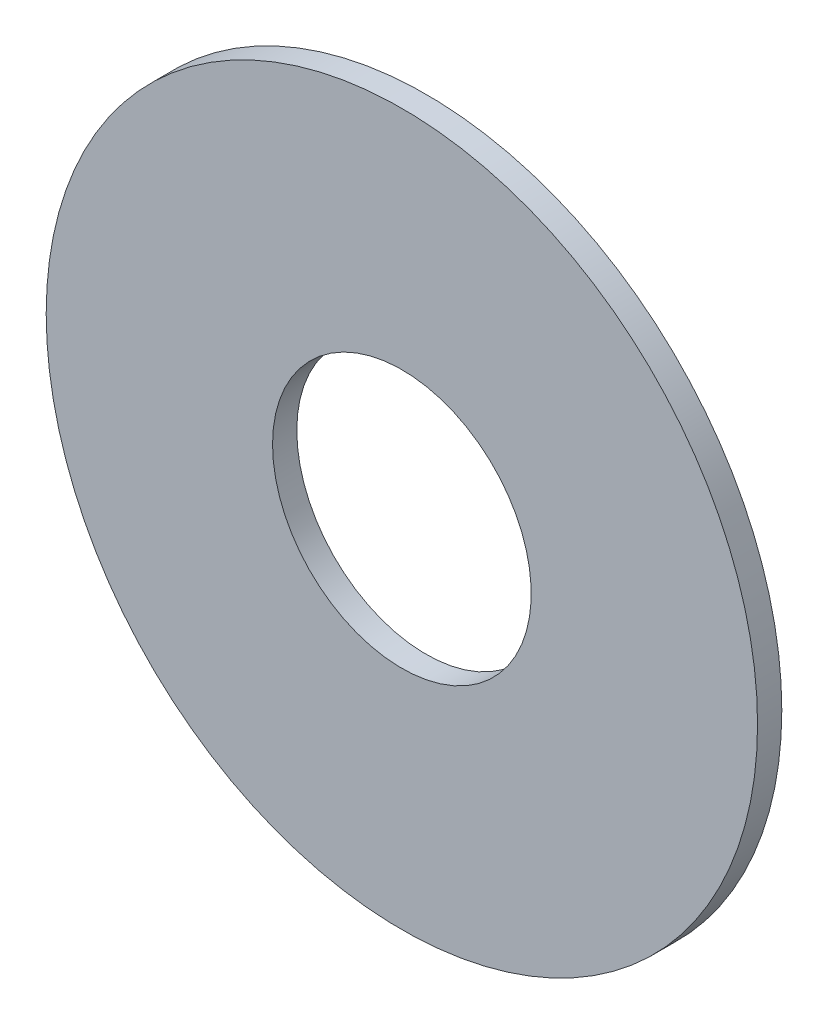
ISO-10303-21;
HEADER;
FILE_DESCRIPTION(('STEP AP214'),'2;1');
FILE_NAME('part.step','',(''),(''),'','','');
FILE_SCHEMA(('AUTOMOTIVE_DESIGN { 1 0 10303 214 1 1 1 1 }'));
ENDSEC;
DATA;
#1=APPLICATION_CONTEXT('core data for automotive mechanical design processes');
#2=APPLICATION_PROTOCOL_DEFINITION('international standard','automotive_design',2000,#1);
#3=PRODUCT_CONTEXT('',#1,'mechanical');
#4=PRODUCT('Part','Part','',(#3));
#5=PRODUCT_RELATED_PRODUCT_CATEGORY('part','',(#4));
#6=PRODUCT_DEFINITION_FORMATION('','',#4);
#7=PRODUCT_DEFINITION_CONTEXT('part definition',#1,'design');
#8=PRODUCT_DEFINITION('design','',#6,#7);
#9=PRODUCT_DEFINITION_SHAPE('','',#8);
#10=(LENGTH_UNIT() NAMED_UNIT(*) SI_UNIT(.MILLI.,.METRE.));
#11=(NAMED_UNIT(*) PLANE_ANGLE_UNIT() SI_UNIT($,.RADIAN.));
#12=(NAMED_UNIT(*) SI_UNIT($,.STERADIAN.) SOLID_ANGLE_UNIT());
#13=UNCERTAINTY_MEASURE_WITH_UNIT(LENGTH_MEASURE(1.E-05),#10,'distance_accuracy_value','');
#14=(GEOMETRIC_REPRESENTATION_CONTEXT(3) GLOBAL_UNCERTAINTY_ASSIGNED_CONTEXT((#13)) GLOBAL_UNIT_ASSIGNED_CONTEXT((#10,
#11,#12)) REPRESENTATION_CONTEXT('',''));
#15=CARTESIAN_POINT('',(0.,0.,0.));
#16=DIRECTION('',(0.,0.,1.));
#17=DIRECTION('',(1.,0.,0.));
#18=AXIS2_PLACEMENT_3D('',#15,#16,#17);
#19=CARTESIAN_POINT('',(0.,0.,1.));
#20=DIRECTION('',(0.,0.,-1.));
#21=DIRECTION('',(-1.,0.,0.));
#22=AXIS2_PLACEMENT_3D('',#19,#20,#21);
#23=CYLINDRICAL_SURFACE('',#22,11.);
#24=CARTESIAN_POINT('',(0.,0.,1.));
#25=DIRECTION('',(0.,0.,-1.));
#26=DIRECTION('',(-1.,0.,0.));
#27=AXIS2_PLACEMENT_3D('',#24,#25,#26);
#28=CIRCLE('',#27,11.);
#29=CARTESIAN_POINT('',(-11.,0.,1.));
#30=VERTEX_POINT('',#29);
#31=EDGE_CURVE('E19',#30,#30,#28,.F.);
#32=ORIENTED_EDGE('',*,*,#31,.F.);
#33=EDGE_LOOP('',(#32));
#34=FACE_BOUND('',#33,.T.);
#35=CARTESIAN_POINT('',(0.,0.,0.25));
#36=DIRECTION('',(0.,0.,-1.));
#37=DIRECTION('',(-1.,0.,0.));
#38=AXIS2_PLACEMENT_3D('',#35,#36,#37);
#39=CIRCLE('',#38,11.);
#40=CARTESIAN_POINT('',(-11.,0.,0.25));
#41=VERTEX_POINT('',#40);
#42=EDGE_CURVE('E28',#41,#41,#39,.T.);
#43=ORIENTED_EDGE('',*,*,#42,.F.);
#44=EDGE_LOOP('',(#43));
#45=FACE_BOUND('',#44,.T.);
#46=ADVANCED_FACE('F15',(#34,#45),#23,.T.);
#47=CARTESIAN_POINT('',(-11.132,-11.132,1.));
#48=DIRECTION('',(0.,0.,1.));
#49=DIRECTION('',(1.,0.,0.));
#50=AXIS2_PLACEMENT_3D('',#47,#48,#49);
#51=PLANE('',#50);
#52=CARTESIAN_POINT('',(0.,0.,1.));
#53=DIRECTION('',(0.,0.,-1.));
#54=DIRECTION('',(-1.,0.,0.));
#55=AXIS2_PLACEMENT_3D('',#52,#53,#54);
#56=CIRCLE('',#55,4.);
#57=CARTESIAN_POINT('',(-4.,0.,1.));
#58=VERTEX_POINT('',#57);
#59=EDGE_CURVE('E23',#58,#58,#56,.F.);
#60=ORIENTED_EDGE('',*,*,#59,.F.);
#61=EDGE_LOOP('',(#60));
#62=FACE_BOUND('',#61,.T.);
#63=ORIENTED_EDGE('',*,*,#31,.T.);
#64=EDGE_LOOP('',(#63));
#65=FACE_BOUND('',#64,.T.);
#66=ADVANCED_FACE('F36',(#62,#65),#51,.T.);
#67=CARTESIAN_POINT('',(11.132,-11.132,0.25));
#68=DIRECTION('',(0.,0.,-1.));
#69=DIRECTION('',(-1.,0.,0.));
#70=AXIS2_PLACEMENT_3D('',#67,#68,#69);
#71=PLANE('',#70);
#72=CARTESIAN_POINT('',(0.,0.,0.25));
#73=DIRECTION('',(0.,0.,-1.));
#74=DIRECTION('',(-1.,0.,0.));
#75=AXIS2_PLACEMENT_3D('',#72,#73,#74);
#76=CIRCLE('',#75,4.);
#77=CARTESIAN_POINT('',(-4.,0.,0.25));
#78=VERTEX_POINT('',#77);
#79=EDGE_CURVE('E10',#78,#78,#76,.T.);
#80=ORIENTED_EDGE('',*,*,#79,.F.);
#81=EDGE_LOOP('',(#80));
#82=FACE_BOUND('',#81,.T.);
#83=ORIENTED_EDGE('',*,*,#42,.T.);
#84=EDGE_LOOP('',(#83));
#85=FACE_BOUND('',#84,.T.);
#86=ADVANCED_FACE('F17',(#82,#85),#71,.T.);
#87=CARTESIAN_POINT('',(0.,0.,1.));
#88=DIRECTION('',(0.,0.,-1.));
#89=DIRECTION('',(-1.,0.,0.));
#90=AXIS2_PLACEMENT_3D('',#87,#88,#89);
#91=CYLINDRICAL_SURFACE('',#90,4.);
#92=ORIENTED_EDGE('',*,*,#59,.T.);
#93=EDGE_LOOP('',(#92));
#94=FACE_BOUND('',#93,.T.);
#95=ORIENTED_EDGE('',*,*,#79,.T.);
#96=EDGE_LOOP('',(#95));
#97=FACE_BOUND('',#96,.T.);
#98=ADVANCED_FACE('F48',(#94,#97),#91,.F.);
#99=CLOSED_SHELL('',(#46,#66,#86,#98));
#100=MANIFOLD_SOLID_BREP('B1',#99);
#101=ADVANCED_BREP_SHAPE_REPRESENTATION('',(#18,#100),#14);
#102=SHAPE_DEFINITION_REPRESENTATION(#9,#101);
ENDSEC;
END-ISO-10303-21;
